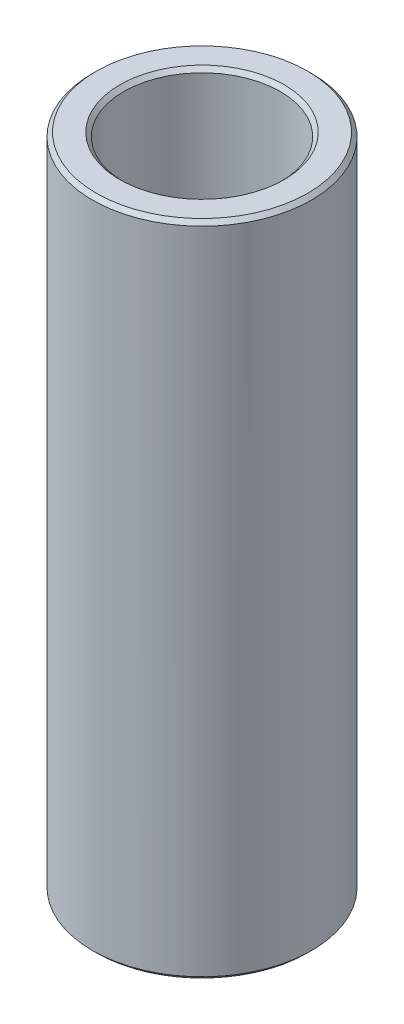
ISO-10303-21;
HEADER;
FILE_DESCRIPTION(('STEP AP214'),'2;1');
FILE_NAME('part.step','',(''),(''),'','','');
FILE_SCHEMA(('AUTOMOTIVE_DESIGN { 1 0 10303 214 1 1 1 1 }'));
ENDSEC;
DATA;
#1=APPLICATION_CONTEXT('core data for automotive mechanical design processes');
#2=APPLICATION_PROTOCOL_DEFINITION('international standard','automotive_design',2000,#1);
#3=PRODUCT_CONTEXT('',#1,'mechanical');
#4=PRODUCT('Part','Part','',(#3));
#5=PRODUCT_RELATED_PRODUCT_CATEGORY('part','',(#4));
#6=PRODUCT_DEFINITION_FORMATION('','',#4);
#7=PRODUCT_DEFINITION_CONTEXT('part definition',#1,'design');
#8=PRODUCT_DEFINITION('design','',#6,#7);
#9=PRODUCT_DEFINITION_SHAPE('','',#8);
#10=(LENGTH_UNIT() NAMED_UNIT(*) SI_UNIT(.MILLI.,.METRE.));
#11=(NAMED_UNIT(*) PLANE_ANGLE_UNIT() SI_UNIT($,.RADIAN.));
#12=(NAMED_UNIT(*) SI_UNIT($,.STERADIAN.) SOLID_ANGLE_UNIT());
#13=UNCERTAINTY_MEASURE_WITH_UNIT(LENGTH_MEASURE(1.E-05),#10,'distance_accuracy_value','');
#14=(GEOMETRIC_REPRESENTATION_CONTEXT(3) GLOBAL_UNCERTAINTY_ASSIGNED_CONTEXT((#13)) GLOBAL_UNIT_ASSIGNED_CONTEXT((#10,
#11,#12)) REPRESENTATION_CONTEXT('',''));
#15=CARTESIAN_POINT('',(0.,0.,0.));
#16=DIRECTION('',(0.,0.,1.));
#17=DIRECTION('',(1.,0.,0.));
#18=AXIS2_PLACEMENT_3D('',#15,#16,#17);
#19=CARTESIAN_POINT('',(0.,0.,0.));
#20=DIRECTION('',(0.,-1.,0.));
#21=DIRECTION('',(0.,0.,-1.));
#22=AXIS2_PLACEMENT_3D('',#19,#20,#21);
#23=CYLINDRICAL_SURFACE('',#22,7.);
#24=CARTESIAN_POINT('',(0.,0.249999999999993,0.));
#25=DIRECTION('',(0.,1.,0.));
#26=DIRECTION('',(0.,0.,1.));
#27=AXIS2_PLACEMENT_3D('',#24,#25,#26);
#28=CIRCLE('',#27,7.);
#29=CARTESIAN_POINT('',(0.,0.249999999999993,7.));
#30=VERTEX_POINT('',#29);
#31=EDGE_CURVE('E59',#30,#30,#28,.T.);
#32=ORIENTED_EDGE('',*,*,#31,.T.);
#33=EDGE_LOOP('',(#32));
#34=FACE_BOUND('',#33,.T.);
#35=CARTESIAN_POINT('',(0.,41.75,0.));
#36=DIRECTION('',(0.,-1.,0.));
#37=DIRECTION('',(0.,0.,-1.));
#38=AXIS2_PLACEMENT_3D('',#35,#36,#37);
#39=CIRCLE('',#38,7.);
#40=CARTESIAN_POINT('',(0.,41.75,-7.));
#41=VERTEX_POINT('',#40);
#42=EDGE_CURVE('E64',#41,#41,#39,.T.);
#43=ORIENTED_EDGE('',*,*,#42,.T.);
#44=EDGE_LOOP('',(#43));
#45=FACE_BOUND('',#44,.T.);
#46=ADVANCED_FACE('F45',(#34,#45),#23,.T.);
#47=CARTESIAN_POINT('',(-7.,42.,0.));
#48=DIRECTION('',(0.,-1.,0.));
#49=DIRECTION('',(0.,0.,-1.));
#50=AXIS2_PLACEMENT_3D('',#47,#48,#49);
#51=PLANE('',#50);
#52=CARTESIAN_POINT('',(0.,42.,0.));
#53=DIRECTION('',(0.,-1.,0.));
#54=DIRECTION('',(0.,0.,-1.));
#55=AXIS2_PLACEMENT_3D('',#52,#53,#54);
#56=CIRCLE('',#55,6.74999999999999);
#57=CARTESIAN_POINT('',(0.,42.,-6.74999999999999));
#58=VERTEX_POINT('',#57);
#59=EDGE_CURVE('E10',#58,#58,#56,.F.);
#60=ORIENTED_EDGE('',*,*,#59,.T.);
#61=EDGE_LOOP('',(#60));
#62=FACE_BOUND('',#61,.T.);
#63=CARTESIAN_POINT('',(0.,42.,0.));
#64=DIRECTION('',(0.,-1.,0.));
#65=DIRECTION('',(0.,0.,-1.));
#66=AXIS2_PLACEMENT_3D('',#63,#64,#65);
#67=CIRCLE('',#66,5.24999999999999);
#68=CARTESIAN_POINT('',(0.,42.,-5.24999999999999));
#69=VERTEX_POINT('',#68);
#70=EDGE_CURVE('E54',#69,#69,#67,.T.);
#71=ORIENTED_EDGE('',*,*,#70,.T.);
#72=EDGE_LOOP('',(#71));
#73=FACE_BOUND('',#72,.T.);
#74=ADVANCED_FACE('F98',(#62,#73),#51,.F.);
#75=CARTESIAN_POINT('',(0.,0.,0.));
#76=DIRECTION('',(0.,-1.,0.));
#77=DIRECTION('',(0.,0.,-1.));
#78=AXIS2_PLACEMENT_3D('',#75,#76,#77);
#79=CYLINDRICAL_SURFACE('',#78,5.);
#80=CARTESIAN_POINT('',(0.,0.249999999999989,0.));
#81=DIRECTION('',(0.,1.,0.));
#82=DIRECTION('',(0.,0.,1.));
#83=AXIS2_PLACEMENT_3D('',#80,#81,#82);
#84=CIRCLE('',#83,5.);
#85=CARTESIAN_POINT('',(0.,0.249999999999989,5.));
#86=VERTEX_POINT('',#85);
#87=EDGE_CURVE('E78',#86,#86,#84,.F.);
#88=ORIENTED_EDGE('',*,*,#87,.T.);
#89=EDGE_LOOP('',(#88));
#90=FACE_BOUND('',#89,.T.);
#91=CARTESIAN_POINT('',(0.,41.75,0.));
#92=DIRECTION('',(0.,-1.,0.));
#93=DIRECTION('',(0.,0.,-1.));
#94=AXIS2_PLACEMENT_3D('',#91,#92,#93);
#95=CIRCLE('',#94,5.);
#96=CARTESIAN_POINT('',(0.,41.75,-5.));
#97=VERTEX_POINT('',#96);
#98=EDGE_CURVE('E82',#97,#97,#95,.F.);
#99=ORIENTED_EDGE('',*,*,#98,.T.);
#100=EDGE_LOOP('',(#99));
#101=FACE_BOUND('',#100,.T.);
#102=ADVANCED_FACE('F87',(#90,#101),#79,.F.);
#103=CARTESIAN_POINT('',(-5.,0.,0.));
#104=DIRECTION('',(0.,1.,0.));
#105=DIRECTION('',(0.,0.,1.));
#106=AXIS2_PLACEMENT_3D('',#103,#104,#105);
#107=PLANE('',#106);
#108=CARTESIAN_POINT('',(0.,0.,0.));
#109=DIRECTION('',(0.,1.,0.));
#110=DIRECTION('',(0.,0.,1.));
#111=AXIS2_PLACEMENT_3D('',#108,#109,#110);
#112=CIRCLE('',#111,5.24999999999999);
#113=CARTESIAN_POINT('',(0.,0.,5.24999999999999));
#114=VERTEX_POINT('',#113);
#115=EDGE_CURVE('E70',#114,#114,#112,.T.);
#116=ORIENTED_EDGE('',*,*,#115,.T.);
#117=EDGE_LOOP('',(#116));
#118=FACE_BOUND('',#117,.T.);
#119=CARTESIAN_POINT('',(0.,0.,0.));
#120=DIRECTION('',(0.,1.,0.));
#121=DIRECTION('',(0.,0.,1.));
#122=AXIS2_PLACEMENT_3D('',#119,#120,#121);
#123=CIRCLE('',#122,6.75000000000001);
#124=CARTESIAN_POINT('',(0.,0.,6.75000000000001));
#125=VERTEX_POINT('',#124);
#126=EDGE_CURVE('E74',#125,#125,#123,.F.);
#127=ORIENTED_EDGE('',*,*,#126,.T.);
#128=EDGE_LOOP('',(#127));
#129=FACE_BOUND('',#128,.T.);
#130=ADVANCED_FACE('F115',(#118,#129),#107,.F.);
#131=CARTESIAN_POINT('',(0.,0.249999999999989,0.));
#132=DIRECTION('',(0.,-1.,0.));
#133=DIRECTION('',(0.,0.,-1.));
#134=AXIS2_PLACEMENT_3D('',#131,#132,#133);
#135=CONICAL_SURFACE('',#134,5.,0.785398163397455);
#136=ORIENTED_EDGE('',*,*,#115,.F.);
#137=EDGE_LOOP('',(#136));
#138=FACE_BOUND('',#137,.T.);
#139=ORIENTED_EDGE('',*,*,#87,.F.);
#140=EDGE_LOOP('',(#139));
#141=FACE_BOUND('',#140,.T.);
#142=ADVANCED_FACE('F109',(#138,#141),#135,.F.);
#143=CARTESIAN_POINT('',(0.,0.,0.));
#144=DIRECTION('',(0.,1.,0.));
#145=DIRECTION('',(0.,0.,1.));
#146=AXIS2_PLACEMENT_3D('',#143,#144,#145);
#147=CONICAL_SURFACE('',#146,6.75000000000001,0.785398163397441);
#148=ORIENTED_EDGE('',*,*,#31,.F.);
#149=EDGE_LOOP('',(#148));
#150=FACE_BOUND('',#149,.T.);
#151=ORIENTED_EDGE('',*,*,#126,.F.);
#152=EDGE_LOOP('',(#151));
#153=FACE_BOUND('',#152,.T.);
#154=ADVANCED_FACE('F95',(#150,#153),#147,.T.);
#155=CARTESIAN_POINT('',(0.,41.75,0.));
#156=DIRECTION('',(0.,-1.,0.));
#157=DIRECTION('',(0.,0.,-1.));
#158=AXIS2_PLACEMENT_3D('',#155,#156,#157);
#159=CONICAL_SURFACE('',#158,7.,0.785398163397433);
#160=ORIENTED_EDGE('',*,*,#59,.F.);
#161=EDGE_LOOP('',(#160));
#162=FACE_BOUND('',#161,.T.);
#163=ORIENTED_EDGE('',*,*,#42,.F.);
#164=EDGE_LOOP('',(#163));
#165=FACE_BOUND('',#164,.T.);
#166=ADVANCED_FACE('F91',(#162,#165),#159,.T.);
#167=CARTESIAN_POINT('',(0.,42.,0.));
#168=DIRECTION('',(0.,1.,0.));
#169=DIRECTION('',(0.,0.,1.));
#170=AXIS2_PLACEMENT_3D('',#167,#168,#169);
#171=CONICAL_SURFACE('',#170,5.24999999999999,0.785398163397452);
#172=ORIENTED_EDGE('',*,*,#98,.F.);
#173=EDGE_LOOP('',(#172));
#174=FACE_BOUND('',#173,.T.);
#175=ORIENTED_EDGE('',*,*,#70,.F.);
#176=EDGE_LOOP('',(#175));
#177=FACE_BOUND('',#176,.T.);
#178=ADVANCED_FACE('F48',(#174,#177),#171,.F.);
#179=CLOSED_SHELL('',(#46,#74,#102,#130,#142,#154,#166,#178));
#180=MANIFOLD_SOLID_BREP('B2',#179);
#181=ADVANCED_BREP_SHAPE_REPRESENTATION('',(#18,#180),#14);
#182=SHAPE_DEFINITION_REPRESENTATION(#9,#181);
ENDSEC;
END-ISO-10303-21;
